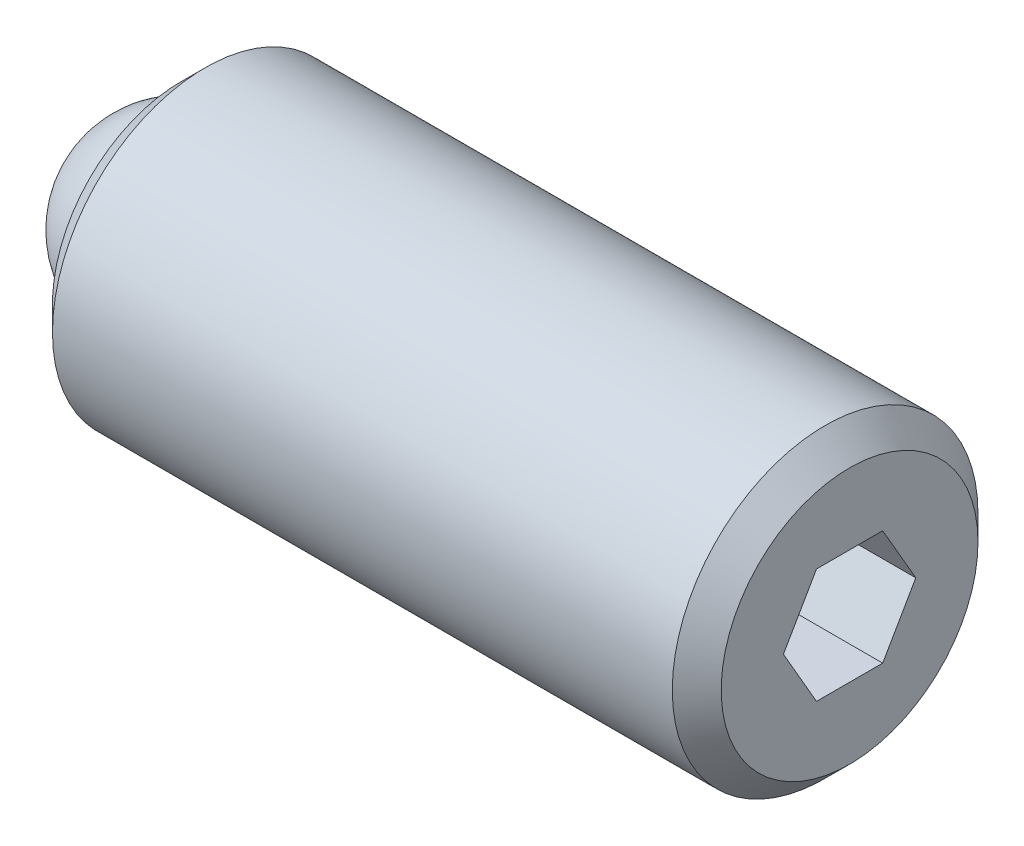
ISO-10303-21;
HEADER;
FILE_DESCRIPTION(('STEP AP214'),'2;1');
FILE_NAME('part.step','',(''),(''),'','','');
FILE_SCHEMA(('AUTOMOTIVE_DESIGN { 1 0 10303 214 1 1 1 1 }'));
ENDSEC;
DATA;
#1=APPLICATION_CONTEXT('core data for automotive mechanical design processes');
#2=APPLICATION_PROTOCOL_DEFINITION('international standard','automotive_design',2000,#1);
#3=PRODUCT_CONTEXT('',#1,'mechanical');
#4=PRODUCT('Part','Part','',(#3));
#5=PRODUCT_RELATED_PRODUCT_CATEGORY('part','',(#4));
#6=PRODUCT_DEFINITION_FORMATION('','',#4);
#7=PRODUCT_DEFINITION_CONTEXT('part definition',#1,'design');
#8=PRODUCT_DEFINITION('design','',#6,#7);
#9=PRODUCT_DEFINITION_SHAPE('','',#8);
#10=(LENGTH_UNIT() NAMED_UNIT(*) SI_UNIT(.MILLI.,.METRE.));
#11=(NAMED_UNIT(*) PLANE_ANGLE_UNIT() SI_UNIT($,.RADIAN.));
#12=(NAMED_UNIT(*) SI_UNIT($,.STERADIAN.) SOLID_ANGLE_UNIT());
#13=UNCERTAINTY_MEASURE_WITH_UNIT(LENGTH_MEASURE(1.E-05),#10,'distance_accuracy_value','');
#14=(GEOMETRIC_REPRESENTATION_CONTEXT(3) GLOBAL_UNCERTAINTY_ASSIGNED_CONTEXT((#13)) GLOBAL_UNIT_ASSIGNED_CONTEXT((#10,
#11,#12)) REPRESENTATION_CONTEXT('',''));
#15=CARTESIAN_POINT('',(0.,0.,0.));
#16=DIRECTION('',(0.,0.,1.));
#17=DIRECTION('',(1.,0.,0.));
#18=AXIS2_PLACEMENT_3D('',#15,#16,#17);
#19=CARTESIAN_POINT('',(0.,0.,0.));
#20=DIRECTION('',(0.,-1.,0.));
#21=DIRECTION('',(0.,0.,1.));
#22=AXIS2_PLACEMENT_3D('',#19,#20,#21);
#23=SPHERICAL_SURFACE('',#22,1.984375);
#24=CARTESIAN_POINT('',(0.,-1.984375,0.));
#25=VERTEX_POINT('',#24);
#26=VERTEX_LOOP('',#25);
#27=FACE_BOUND('',#26,.T.);
#28=ADVANCED_FACE('F41',(#27),#23,.T.);
#29=CLOSED_SHELL('',(#28));
#30=MANIFOLD_SOLID_BREP('B2',#29);
#31=CARTESIAN_POINT('',(13.890625,0.,0.));
#32=DIRECTION('',(-1.,0.,0.));
#33=DIRECTION('',(0.,0.,1.));
#34=AXIS2_PLACEMENT_3D('',#31,#32,#33);
#35=CYLINDRICAL_SURFACE('',#34,3.175);
#36=CARTESIAN_POINT('',(13.382625,0.,0.));
#37=DIRECTION('',(1.,0.,0.));
#38=DIRECTION('',(0.,0.,-1.));
#39=AXIS2_PLACEMENT_3D('',#36,#37,#38);
#40=CIRCLE('',#39,3.175);
#41=CARTESIAN_POINT('',(13.382625,0.,-3.175));
#42=VERTEX_POINT('',#41);
#43=EDGE_CURVE('E39',#42,#42,#40,.F.);
#44=ORIENTED_EDGE('',*,*,#43,.T.);
#45=EDGE_LOOP('',(#44));
#46=FACE_BOUND('',#45,.T.);
#47=CARTESIAN_POINT('',(0.508,0.,0.));
#48=DIRECTION('',(1.,0.,0.));
#49=DIRECTION('',(0.,0.,-1.));
#50=AXIS2_PLACEMENT_3D('',#47,#48,#49);
#51=CIRCLE('',#50,3.175);
#52=CARTESIAN_POINT('',(0.508,0.,-3.175));
#53=VERTEX_POINT('',#52);
#54=EDGE_CURVE('E157',#53,#53,#51,.T.);
#55=ORIENTED_EDGE('',*,*,#54,.T.);
#56=EDGE_LOOP('',(#55));
#57=FACE_BOUND('',#56,.T.);
#58=ADVANCED_FACE('F54',(#46,#57),#35,.T.);
#59=CARTESIAN_POINT('',(13.890625,0.,0.));
#60=DIRECTION('',(1.,0.,0.));
#61=DIRECTION('',(0.,0.,-1.));
#62=AXIS2_PLACEMENT_3D('',#59,#60,#61);
#63=PLANE('',#62);
#64=DIRECTION('',(0.,0.866025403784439,-0.5));
#65=VECTOR('',#64,1.);
#66=CARTESIAN_POINT('',(13.890625,-1.190625,-0.687407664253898));
#67=LINE('',#66,#65);
#68=CARTESIAN_POINT('',(13.890625,-1.190625,-0.687407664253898));
#69=VERTEX_POINT('',#68);
#70=CARTESIAN_POINT('',(13.890625,0.,-1.3748153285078));
#71=VERTEX_POINT('',#70);
#72=EDGE_CURVE('E69',#69,#71,#67,.T.);
#73=ORIENTED_EDGE('',*,*,#72,.F.);
#74=DIRECTION('',(0.,0.,-1.));
#75=VECTOR('',#74,1.);
#76=CARTESIAN_POINT('',(13.890625,-1.190625,0.687407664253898));
#77=LINE('',#76,#75);
#78=CARTESIAN_POINT('',(13.890625,-1.190625,0.687407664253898));
#79=VERTEX_POINT('',#78);
#80=EDGE_CURVE('E153',#79,#69,#77,.T.);
#81=ORIENTED_EDGE('',*,*,#80,.F.);
#82=DIRECTION('',(0.,-0.866025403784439,-0.5));
#83=VECTOR('',#82,1.);
#84=CARTESIAN_POINT('',(13.890625,0.,1.3748153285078));
#85=LINE('',#84,#83);
#86=CARTESIAN_POINT('',(13.890625,0.,1.3748153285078));
#87=VERTEX_POINT('',#86);
#88=EDGE_CURVE('E151',#87,#79,#85,.T.);
#89=ORIENTED_EDGE('',*,*,#88,.F.);
#90=DIRECTION('',(0.,-0.866025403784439,0.5));
#91=VECTOR('',#90,1.);
#92=CARTESIAN_POINT('',(13.890625,1.190625,0.687407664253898));
#93=LINE('',#92,#91);
#94=CARTESIAN_POINT('',(13.890625,1.190625,0.687407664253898));
#95=VERTEX_POINT('',#94);
#96=EDGE_CURVE('E117',#95,#87,#93,.T.);
#97=ORIENTED_EDGE('',*,*,#96,.F.);
#98=DIRECTION('',(0.,0.,1.));
#99=VECTOR('',#98,1.);
#100=CARTESIAN_POINT('',(13.890625,1.190625,-0.687407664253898));
#101=LINE('',#100,#99);
#102=CARTESIAN_POINT('',(13.890625,1.190625,-0.687407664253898));
#103=VERTEX_POINT('',#102);
#104=EDGE_CURVE('E147',#103,#95,#101,.T.);
#105=ORIENTED_EDGE('',*,*,#104,.F.);
#106=DIRECTION('',(0.,0.866025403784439,0.5));
#107=VECTOR('',#106,1.);
#108=CARTESIAN_POINT('',(13.890625,0.,-1.3748153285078));
#109=LINE('',#108,#107);
#110=EDGE_CURVE('E143',#71,#103,#109,.T.);
#111=ORIENTED_EDGE('',*,*,#110,.F.);
#112=EDGE_LOOP('',(#73,#81,#89,#97,#105,#111));
#113=FACE_BOUND('',#112,.T.);
#114=CARTESIAN_POINT('',(13.890625,0.,0.));
#115=DIRECTION('',(1.,0.,0.));
#116=DIRECTION('',(0.,0.,-1.));
#117=AXIS2_PLACEMENT_3D('',#114,#115,#116);
#118=CIRCLE('',#117,2.667);
#119=CARTESIAN_POINT('',(13.890625,0.,-2.667));
#120=VERTEX_POINT('',#119);
#121=EDGE_CURVE('E62',#120,#120,#118,.T.);
#122=ORIENTED_EDGE('',*,*,#121,.T.);
#123=EDGE_LOOP('',(#122));
#124=FACE_BOUND('',#123,.T.);
#125=ADVANCED_FACE('F170',(#113,#124),#63,.T.);
#126=CARTESIAN_POINT('',(0.,0.,0.));
#127=DIRECTION('',(1.,0.,0.));
#128=DIRECTION('',(0.,0.,-1.));
#129=AXIS2_PLACEMENT_3D('',#126,#127,#128);
#130=PLANE('',#129);
#131=CARTESIAN_POINT('',(0.,0.,0.));
#132=DIRECTION('',(-1.,0.,0.));
#133=DIRECTION('',(0.,0.,1.));
#134=AXIS2_PLACEMENT_3D('',#131,#132,#133);
#135=CIRCLE('',#134,1.9812);
#136=CARTESIAN_POINT('',(0.,0.,1.9812));
#137=VERTEX_POINT('',#136);
#138=EDGE_CURVE('E225',#137,#137,#135,.T.);
#139=ORIENTED_EDGE('',*,*,#138,.F.);
#140=EDGE_LOOP('',(#139));
#141=FACE_BOUND('',#140,.T.);
#142=CARTESIAN_POINT('',(0.,0.,0.));
#143=DIRECTION('',(1.,0.,0.));
#144=DIRECTION('',(0.,0.,-1.));
#145=AXIS2_PLACEMENT_3D('',#142,#143,#144);
#146=CIRCLE('',#145,2.667);
#147=CARTESIAN_POINT('',(0.,0.,-2.667));
#148=VERTEX_POINT('',#147);
#149=EDGE_CURVE('E165',#148,#148,#146,.F.);
#150=ORIENTED_EDGE('',*,*,#149,.T.);
#151=EDGE_LOOP('',(#150));
#152=FACE_BOUND('',#151,.T.);
#153=ADVANCED_FACE('F182',(#141,#152),#130,.F.);
#154=CARTESIAN_POINT('',(0.508,0.,0.));
#155=DIRECTION('',(1.,0.,0.));
#156=DIRECTION('',(0.,0.,-1.));
#157=AXIS2_PLACEMENT_3D('',#154,#155,#156);
#158=CONICAL_SURFACE('',#157,3.175,0.78539816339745);
#159=ORIENTED_EDGE('',*,*,#149,.F.);
#160=EDGE_LOOP('',(#159));
#161=FACE_BOUND('',#160,.T.);
#162=ORIENTED_EDGE('',*,*,#54,.F.);
#163=EDGE_LOOP('',(#162));
#164=FACE_BOUND('',#163,.T.);
#165=ADVANCED_FACE('F174',(#161,#164),#158,.T.);
#166=CARTESIAN_POINT('',(13.890625,0.,0.));
#167=DIRECTION('',(-1.,0.,0.));
#168=DIRECTION('',(0.,0.,1.));
#169=AXIS2_PLACEMENT_3D('',#166,#167,#168);
#170=CONICAL_SURFACE('',#169,2.667,0.785398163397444);
#171=ORIENTED_EDGE('',*,*,#43,.F.);
#172=EDGE_LOOP('',(#171));
#173=FACE_BOUND('',#172,.T.);
#174=ORIENTED_EDGE('',*,*,#121,.F.);
#175=EDGE_LOOP('',(#174));
#176=FACE_BOUND('',#175,.T.);
#177=ADVANCED_FACE('F56',(#173,#176),#170,.T.);
#178=CARTESIAN_POINT('',(11.604625,-1.190625,-0.687407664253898));
#179=DIRECTION('',(0.,-0.5,-0.866025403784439));
#180=DIRECTION('',(0.,0.866025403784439,-0.5));
#181=AXIS2_PLACEMENT_3D('',#178,#179,#180);
#182=PLANE('',#181);
#183=ORIENTED_EDGE('',*,*,#72,.T.);
#184=DIRECTION('',(1.,0.,0.));
#185=VECTOR('',#184,1.);
#186=CARTESIAN_POINT('',(11.604625,0.,-1.3748153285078));
#187=LINE('',#186,#185);
#188=CARTESIAN_POINT('',(11.604625,0.,-1.3748153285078));
#189=VERTEX_POINT('',#188);
#190=EDGE_CURVE('E99',#189,#71,#187,.T.);
#191=ORIENTED_EDGE('',*,*,#190,.F.);
#192=DIRECTION('',(0.,0.866025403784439,-0.5));
#193=VECTOR('',#192,1.);
#194=CARTESIAN_POINT('',(11.604625,-1.190625,-0.687407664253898));
#195=LINE('',#194,#193);
#196=CARTESIAN_POINT('',(11.604625,-1.190625,-0.687407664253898));
#197=VERTEX_POINT('',#196);
#198=EDGE_CURVE('E155',#197,#189,#195,.T.);
#199=ORIENTED_EDGE('',*,*,#198,.F.);
#200=DIRECTION('',(1.,0.,0.));
#201=VECTOR('',#200,1.);
#202=CARTESIAN_POINT('',(11.604625,-1.190625,-0.687407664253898));
#203=LINE('',#202,#201);
#204=EDGE_CURVE('E77',#197,#69,#203,.T.);
#205=ORIENTED_EDGE('',*,*,#204,.T.);
#206=EDGE_LOOP('',(#183,#191,#199,#205));
#207=FACE_BOUND('',#206,.T.);
#208=ADVANCED_FACE('F173',(#207),#182,.F.);
#209=CARTESIAN_POINT('',(11.604625,-1.190625,0.687407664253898));
#210=DIRECTION('',(0.,-1.,0.));
#211=DIRECTION('',(0.,0.,-1.));
#212=AXIS2_PLACEMENT_3D('',#209,#210,#211);
#213=PLANE('',#212);
#214=ORIENTED_EDGE('',*,*,#80,.T.);
#215=ORIENTED_EDGE('',*,*,#204,.F.);
#216=DIRECTION('',(0.,0.,-1.));
#217=VECTOR('',#216,1.);
#218=CARTESIAN_POINT('',(11.604625,-1.190625,0.687407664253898));
#219=LINE('',#218,#217);
#220=CARTESIAN_POINT('',(11.604625,-1.190625,0.687407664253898));
#221=VERTEX_POINT('',#220);
#222=EDGE_CURVE('E129',#221,#197,#219,.T.);
#223=ORIENTED_EDGE('',*,*,#222,.F.);
#224=DIRECTION('',(1.,0.,0.));
#225=VECTOR('',#224,1.);
#226=CARTESIAN_POINT('',(11.604625,-1.190625,0.687407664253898));
#227=LINE('',#226,#225);
#228=EDGE_CURVE('E121',#221,#79,#227,.T.);
#229=ORIENTED_EDGE('',*,*,#228,.T.);
#230=EDGE_LOOP('',(#214,#215,#223,#229));
#231=FACE_BOUND('',#230,.T.);
#232=ADVANCED_FACE('F180',(#231),#213,.F.);
#233=CARTESIAN_POINT('',(11.604625,0.,1.3748153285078));
#234=DIRECTION('',(0.,-0.5,0.866025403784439));
#235=DIRECTION('',(0.,-0.866025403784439,-0.5));
#236=AXIS2_PLACEMENT_3D('',#233,#234,#235);
#237=PLANE('',#236);
#238=ORIENTED_EDGE('',*,*,#88,.T.);
#239=ORIENTED_EDGE('',*,*,#228,.F.);
#240=DIRECTION('',(0.,-0.866025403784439,-0.5));
#241=VECTOR('',#240,1.);
#242=CARTESIAN_POINT('',(11.604625,0.,1.3748153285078));
#243=LINE('',#242,#241);
#244=CARTESIAN_POINT('',(11.604625,0.,1.3748153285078));
#245=VERTEX_POINT('',#244);
#246=EDGE_CURVE('E125',#245,#221,#243,.T.);
#247=ORIENTED_EDGE('',*,*,#246,.F.);
#248=DIRECTION('',(1.,0.,0.));
#249=VECTOR('',#248,1.);
#250=CARTESIAN_POINT('',(11.604625,0.,1.3748153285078));
#251=LINE('',#250,#249);
#252=EDGE_CURVE('E110',#245,#87,#251,.T.);
#253=ORIENTED_EDGE('',*,*,#252,.T.);
#254=EDGE_LOOP('',(#238,#239,#247,#253));
#255=FACE_BOUND('',#254,.T.);
#256=ADVANCED_FACE('F126',(#255),#237,.F.);
#257=CARTESIAN_POINT('',(11.604625,1.190625,0.687407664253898));
#258=DIRECTION('',(0.,0.5,0.866025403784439));
#259=DIRECTION('',(0.,-0.866025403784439,0.5));
#260=AXIS2_PLACEMENT_3D('',#257,#258,#259);
#261=PLANE('',#260);
#262=ORIENTED_EDGE('',*,*,#96,.T.);
#263=ORIENTED_EDGE('',*,*,#252,.F.);
#264=DIRECTION('',(0.,-0.866025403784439,0.5));
#265=VECTOR('',#264,1.);
#266=CARTESIAN_POINT('',(11.604625,1.190625,0.687407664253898));
#267=LINE('',#266,#265);
#268=CARTESIAN_POINT('',(11.604625,1.190625,0.687407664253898));
#269=VERTEX_POINT('',#268);
#270=EDGE_CURVE('E114',#269,#245,#267,.T.);
#271=ORIENTED_EDGE('',*,*,#270,.F.);
#272=DIRECTION('',(1.,0.,0.));
#273=VECTOR('',#272,1.);
#274=CARTESIAN_POINT('',(11.604625,1.190625,0.687407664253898));
#275=LINE('',#274,#273);
#276=EDGE_CURVE('E122',#269,#95,#275,.T.);
#277=ORIENTED_EDGE('',*,*,#276,.T.);
#278=EDGE_LOOP('',(#262,#263,#271,#277));
#279=FACE_BOUND('',#278,.T.);
#280=ADVANCED_FACE('F112',(#279),#261,.F.);
#281=CARTESIAN_POINT('',(11.604625,1.190625,-0.687407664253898));
#282=DIRECTION('',(0.,1.,0.));
#283=DIRECTION('',(0.,0.,1.));
#284=AXIS2_PLACEMENT_3D('',#281,#282,#283);
#285=PLANE('',#284);
#286=ORIENTED_EDGE('',*,*,#104,.T.);
#287=ORIENTED_EDGE('',*,*,#276,.F.);
#288=DIRECTION('',(0.,0.,1.));
#289=VECTOR('',#288,1.);
#290=CARTESIAN_POINT('',(11.604625,1.190625,-0.687407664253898));
#291=LINE('',#290,#289);
#292=CARTESIAN_POINT('',(11.604625,1.190625,-0.687407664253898));
#293=VERTEX_POINT('',#292);
#294=EDGE_CURVE('E135',#293,#269,#291,.T.);
#295=ORIENTED_EDGE('',*,*,#294,.F.);
#296=DIRECTION('',(1.,0.,0.));
#297=VECTOR('',#296,1.);
#298=CARTESIAN_POINT('',(11.604625,1.190625,-0.687407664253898));
#299=LINE('',#298,#297);
#300=EDGE_CURVE('E160',#293,#103,#299,.T.);
#301=ORIENTED_EDGE('',*,*,#300,.T.);
#302=EDGE_LOOP('',(#286,#287,#295,#301));
#303=FACE_BOUND('',#302,.T.);
#304=ADVANCED_FACE('F201',(#303),#285,.F.);
#305=CARTESIAN_POINT('',(11.604625,0.,-1.3748153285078));
#306=DIRECTION('',(0.,0.5,-0.866025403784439));
#307=DIRECTION('',(0.,0.866025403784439,0.5));
#308=AXIS2_PLACEMENT_3D('',#305,#306,#307);
#309=PLANE('',#308);
#310=ORIENTED_EDGE('',*,*,#110,.T.);
#311=ORIENTED_EDGE('',*,*,#300,.F.);
#312=DIRECTION('',(0.,0.866025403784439,0.5));
#313=VECTOR('',#312,1.);
#314=CARTESIAN_POINT('',(11.604625,0.,-1.3748153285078));
#315=LINE('',#314,#313);
#316=EDGE_CURVE('E137',#189,#293,#315,.T.);
#317=ORIENTED_EDGE('',*,*,#316,.F.);
#318=ORIENTED_EDGE('',*,*,#190,.T.);
#319=EDGE_LOOP('',(#310,#311,#317,#318));
#320=FACE_BOUND('',#319,.T.);
#321=ADVANCED_FACE('F198',(#320),#309,.F.);
#322=CARTESIAN_POINT('',(11.604625,0.,0.));
#323=DIRECTION('',(1.,0.,0.));
#324=DIRECTION('',(0.,0.,-1.));
#325=AXIS2_PLACEMENT_3D('',#322,#323,#324);
#326=PLANE('',#325);
#327=ORIENTED_EDGE('',*,*,#198,.T.);
#328=ORIENTED_EDGE('',*,*,#316,.T.);
#329=ORIENTED_EDGE('',*,*,#294,.T.);
#330=ORIENTED_EDGE('',*,*,#270,.T.);
#331=ORIENTED_EDGE('',*,*,#246,.T.);
#332=ORIENTED_EDGE('',*,*,#222,.T.);
#333=EDGE_LOOP('',(#327,#328,#329,#330,#331,#332));
#334=FACE_BOUND('',#333,.T.);
#335=ADVANCED_FACE('F132',(#334),#326,.T.);
#336=CARTESIAN_POINT('',(1.984375,0.,0.));
#337=DIRECTION('',(-1.,0.,0.));
#338=DIRECTION('',(0.,0.,1.));
#339=AXIS2_PLACEMENT_3D('',#336,#337,#338);
#340=CYLINDRICAL_SURFACE('',#339,1.9812);
#341=CARTESIAN_POINT('',(1.984375,0.,0.));
#342=DIRECTION('',(-1.,0.,0.));
#343=DIRECTION('',(0.,0.,1.));
#344=AXIS2_PLACEMENT_3D('',#341,#342,#343);
#345=CIRCLE('',#344,1.9812);
#346=CARTESIAN_POINT('',(1.984375,0.,1.9812));
#347=VERTEX_POINT('',#346);
#348=EDGE_CURVE('E144',#347,#347,#345,.T.);
#349=ORIENTED_EDGE('',*,*,#348,.F.);
#350=EDGE_LOOP('',(#349));
#351=FACE_BOUND('',#350,.T.);
#352=ORIENTED_EDGE('',*,*,#138,.T.);
#353=EDGE_LOOP('',(#352));
#354=FACE_BOUND('',#353,.T.);
#355=ADVANCED_FACE('F214',(#351,#354),#340,.F.);
#356=CARTESIAN_POINT('',(1.984375,0.,0.));
#357=DIRECTION('',(-1.,0.,0.));
#358=DIRECTION('',(0.,0.,1.));
#359=AXIS2_PLACEMENT_3D('',#356,#357,#358);
#360=PLANE('',#359);
#361=ORIENTED_EDGE('',*,*,#348,.T.);
#362=EDGE_LOOP('',(#361));
#363=FACE_BOUND('',#362,.T.);
#364=ADVANCED_FACE('F217',(#363),#360,.T.);
#365=CLOSED_SHELL('',(#58,#125,#153,#165,#177,#208,#232,#256,#280,#304,#321,#335,#355,#364));
#366=MANIFOLD_SOLID_BREP('B6',#365);
#367=ADVANCED_BREP_SHAPE_REPRESENTATION('',(#18,#30,#366),#14);
#368=SHAPE_DEFINITION_REPRESENTATION(#9,#367);
ENDSEC;
END-ISO-10303-21;
